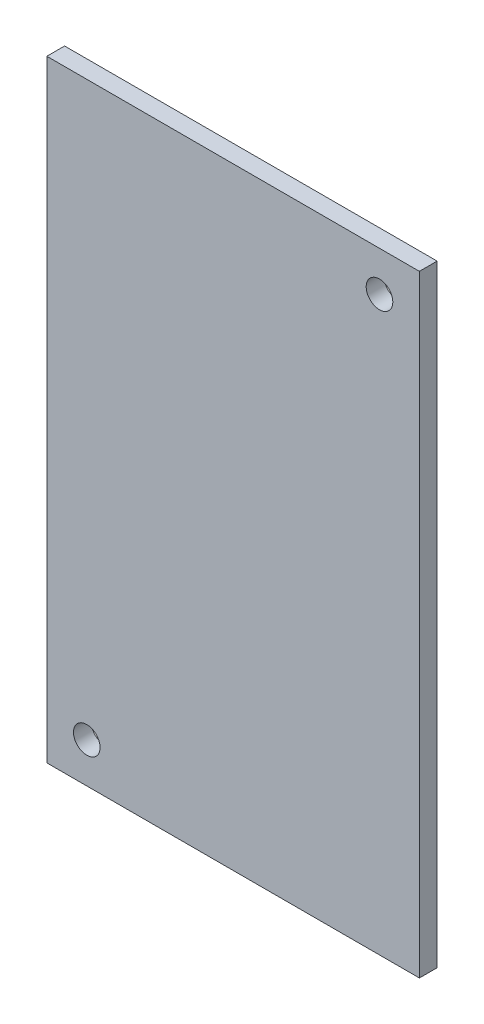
from build123d import *

# Parameters (mm, degrees)
CROQUIS2_W              = 42
CROQUIS2_H              = 69
CROQUIS2_R              = 1.5
SALIENTE_EXTRUIR1_DEPTH = 2


with BuildPart() as part:
    # Croquis2 → Saliente-Extruir1 (new body)
    with BuildSketch(Plane.XY.offset(59.192566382)):
        with Locations((75.452559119, 63.604824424)):
            Rectangle(CROQUIS2_W, CROQUIS2_H)
        with Locations(Location((58.952559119, 33.604824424, 0), (0, 0, 180))):
            Circle(CROQUIS2_R, mode=Mode.SUBTRACT)
        with Locations(Location((91.952559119, 93.604824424, 0), (0, 0, 180))):
            Circle(CROQUIS2_R, mode=Mode.SUBTRACT)
    extrude(amount=SALIENTE_EXTRUIR1_DEPTH)


solid = part.part
